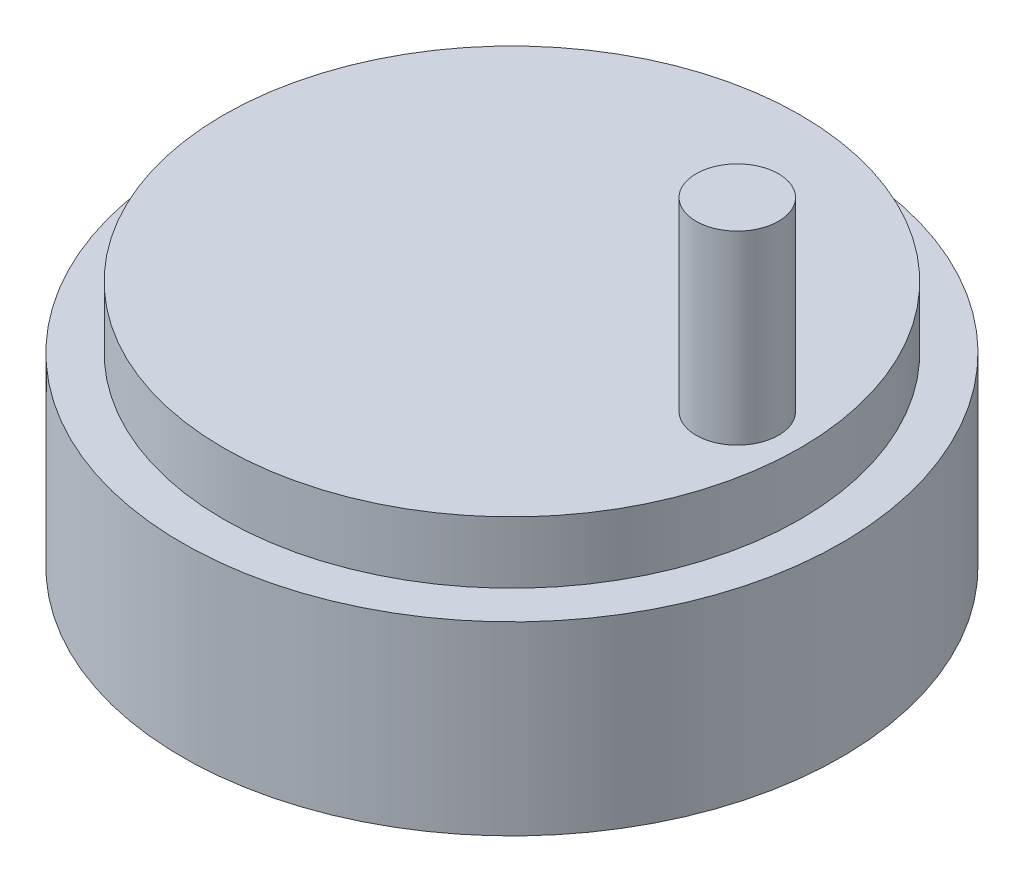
from build123d import *

# Parameters (mm, degrees)
SKETCH1_R           = 7
BOSS_EXTRUDE1_DEPTH = 6
SKETCH2_R           = 1
BOSS_EXTRUDE2_DEPTH = 4.5
SKETCH3_R           = 8
BOSS_EXTRUDE3_DEPTH = 4.5


with BuildPart() as part:
    # Sketch1 → Boss-Extrude1 (new body)
    with BuildSketch(Plane(origin=(0, 0, 0), x_dir=(1, 0, 0), z_dir=(0, 1, 0))):
        with Locations(Location((0, 0, 0), (0, 0, 270))):
            Circle(SKETCH1_R)
    extrude(amount=BOSS_EXTRUDE1_DEPTH)

    # Sketch2 → Boss-Extrude2 (add)
    with BuildSketch(Plane(origin=(0, 6, 0), x_dir=(1, 0, 0), z_dir=(0, 1, 0))):
        with Locations(Location((5.47095, 0, 0), (0, 0, 270))):
            Circle(SKETCH2_R)
    extrude(amount=BOSS_EXTRUDE2_DEPTH)

    # Sketch3 → Boss-Extrude3 (add)
    with BuildSketch(Plane.XZ):
        with Locations(Location((0, 0, 0), (0, 0, 270))):
            Circle(SKETCH3_R)
    extrude(amount=-BOSS_EXTRUDE3_DEPTH)


solid = part.part
